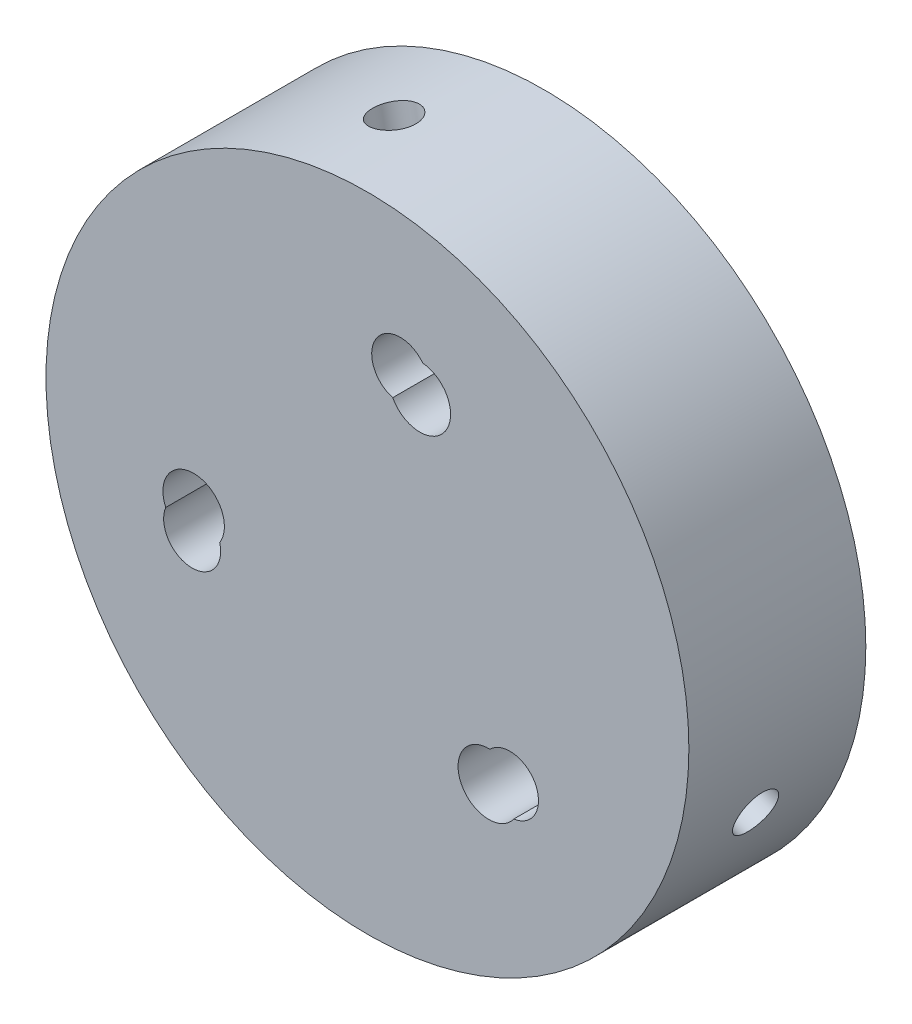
from build123d import *

# Parameters (mm, degrees)
SKETCH1_R             = 12.4587
BLOCK_DEPTH           = 6.858
SKETCH2_R             = 0.5969
EXHAUST_THRU_DEPTH    = 19.906892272
EXHAUST_CHAMFER_SIZE  = 0.4826
EXHAUST_CHAMFER_SIZE2 = 0.555167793
SKETCH3_R             = 0.5969
INTAKE_DEPTH          = 3.556
SKETCH4_R             = 4.2672
SKETCH4_R_2           = 2.9972
ORING_GROOVE_DEPTH    = 0.7112
GROOVE_REPEAT_COUNT   = 3
SKETCH5_R             = 1.1811
CENTER_HOLE_DEPTH     = 4.826
SKETCH6_R             = 1.6256
ALIGNMENT_HOLE_DEPTH  = 4.445
SKETCH7_R             = 1.1049
TOP_SEAT_DEPTH        = 1.4478
SEAT_REPEAT_COUNT     = 3
SKETCH8_R             = 0.8509
SIDE_PORT_DEPTH       = 15.24
PORT_REPEAT_COUNT     = 3
SKETCH10_R            = 1.1049
BOTTOM_SEAT_DEPTH     = 5.08
BOT_REPEAT_COUNT      = 3
SKETCH12_R            = 1.190625
KEEPER_HOLE_DEPTH     = 3.6322
CIRPATTERN6_COUNT     = 3


with BuildPart() as part:
    # Sketch1 → block (new body)
    with BuildSketch(Plane.XY):
        Circle(SKETCH1_R)
    extrude(amount=BLOCK_DEPTH)

    # Sketch2 → exhaust_thru (cut, through all)
    with BuildSketch(Plane.XY.offset(6.858)):
        with Locations((1.27, 7.112)):
            Circle(SKETCH2_R)
        with Locations((5.525132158, -4.655505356)):
            Circle(SKETCH2_R)
        with Locations((-6.793392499, -2.456805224)):
            Circle(SKETCH2_R)
    extrude(amount=-EXHAUST_THRU_DEPTH, mode=Mode.SUBTRACT)

    # exhaust_chamfer
    exhaust_chamfer_edges = [part.edges().sort_by_distance(p)[0] for p in [
        (-7.390292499, -2.456805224, 0),
        (0.6731, 7.112, 0),
        (4.928232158, -4.655505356, 0),
    ]]
    exhaust_chamfer_side = [part.faces().sort_by_distance(p)[0] for p in [
        (-4.021e-06, 7.18e-07, 0),
    ]]
    chamfer(exhaust_chamfer_edges, length=EXHAUST_CHAMFER_SIZE, length2=EXHAUST_CHAMFER_SIZE2, reference=exhaust_chamfer_side[0])

    # Sketch3 → intake (cut)
    with BuildSketch(Plane(origin=(0, 0, 0), x_dir=(-1, 0, 0), z_dir=(0, 0, -1))):
        with Locations((1.27, 7.112)):
            Circle(SKETCH3_R)
        with Locations((5.524172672, -4.655852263)):
            Circle(SKETCH3_R)
        with Locations((-6.794172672, -2.456147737)):
            Circle(SKETCH3_R)
    extrude(amount=-INTAKE_DEPTH, mode=Mode.SUBTRACT)

    # Sketch4 → oring_groove (cut)
    with BuildSketch(Plane(origin=(0, 0, 0), x_dir=(-1, 0, 0), z_dir=(0, 0, -1))):
        with Locations((0, 6.35)):
            Circle(SKETCH4_R)
        with Locations((0, 6.35)):
            Circle(SKETCH4_R_2, mode=Mode.SUBTRACT)
    oring_groove = extrude(amount=-ORING_GROOVE_DEPTH, mode=Mode.SUBTRACT)

    # groove_repeat: oring_groove ×3 about axis
    groove_repeat_axis = Axis((0, 0, 0), (0, 0, 1))
    for i in range(1, GROOVE_REPEAT_COUNT):
        add(oring_groove.rotate(groove_repeat_axis, i * 360 / GROOVE_REPEAT_COUNT), mode=Mode.SUBTRACT)

    # Sketch5 → center_hole (cut)
    with BuildSketch(Plane(origin=(0, 0, 0), x_dir=(-1, 0, 0), z_dir=(0, 0, -1))):
        Circle(SKETCH5_R)
    extrude(amount=-CENTER_HOLE_DEPTH, mode=Mode.SUBTRACT)

    # Sketch6 → alignment_hole (cut)
    with BuildSketch(Plane(origin=(0, 0, 0), x_dir=(-1, 0, 0), z_dir=(0, 0, -1))):
        with Locations((0, -7.0104)):
            Circle(SKETCH6_R)
    extrude(amount=-ALIGNMENT_HOLE_DEPTH, mode=Mode.SUBTRACT)

    # Sketch7 → top_seat (cut)
    with BuildSketch(Plane(origin=(0, 0, 0), x_dir=(-1, 0, 0), z_dir=(0, 0, -1))):
        with Locations((1.27, 7.112)):
            Circle(SKETCH7_R)
    top_seat = extrude(amount=-TOP_SEAT_DEPTH, mode=Mode.SUBTRACT)

    # seat_repeat: top_seat ×3 about axis
    seat_repeat_axis = Axis((0, 0, 0), (0, 0, 1))
    for i in range(1, SEAT_REPEAT_COUNT):
        add(top_seat.rotate(seat_repeat_axis, i * 360 / SEAT_REPEAT_COUNT), mode=Mode.SUBTRACT)

    # Sketch8 → side_port (cut)
    with BuildSketch(Plane(origin=(0, 0, 0), x_dir=(-0.9832549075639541, -0.18223552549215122, 0), z_dir=(-0.18223552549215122, 0.9832549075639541, 0))):
        with Locations(Location((0, 3.556, 0), (0, 0, 180))):
            Circle(SKETCH8_R)
    side_port = extrude(amount=SIDE_PORT_DEPTH, mode=Mode.SUBTRACT)

    # port_repeat: side_port ×3 about axis
    port_repeat_axis = Axis((0, 0, 0), (0, 0, -1))
    for i in range(1, PORT_REPEAT_COUNT):
        add(side_port.rotate(port_repeat_axis, i * 360 / PORT_REPEAT_COUNT), mode=Mode.SUBTRACT)

    # Sketch10 → bottom_seat (cut)
    with BuildSketch(Plane.XY.offset(6.858)):
        with Locations((1.27, 7.112)):
            Circle(SKETCH10_R)
    bottom_seat = extrude(amount=-BOTTOM_SEAT_DEPTH, mode=Mode.SUBTRACT)

    # bot_repeat: bottom_seat ×3 about axis
    bot_repeat_axis = Axis((0, 0, 0), (0, 0, 1))
    for i in range(1, BOT_REPEAT_COUNT):
        add(bottom_seat.rotate(bot_repeat_axis, i * 360 / BOT_REPEAT_COUNT), mode=Mode.SUBTRACT)

    # Sketch12 → keeper_hole (cut)
    with BuildSketch(Plane.XY.offset(6.858)):
        with Locations((2.032, 6.604)):
            Circle(SKETCH12_R)
    keeper_hole = extrude(amount=-KEEPER_HOLE_DEPTH, mode=Mode.SUBTRACT)

    # CirPattern6: keeper_hole ×3 about axis
    cirpattern6_axis = Axis((0, 0, 0), (0, 0, 1))
    for i in range(1, CIRPATTERN6_COUNT):
        add(keeper_hole.rotate(cirpattern6_axis, i * 360 / CIRPATTERN6_COUNT), mode=Mode.SUBTRACT)


solid = part.part
